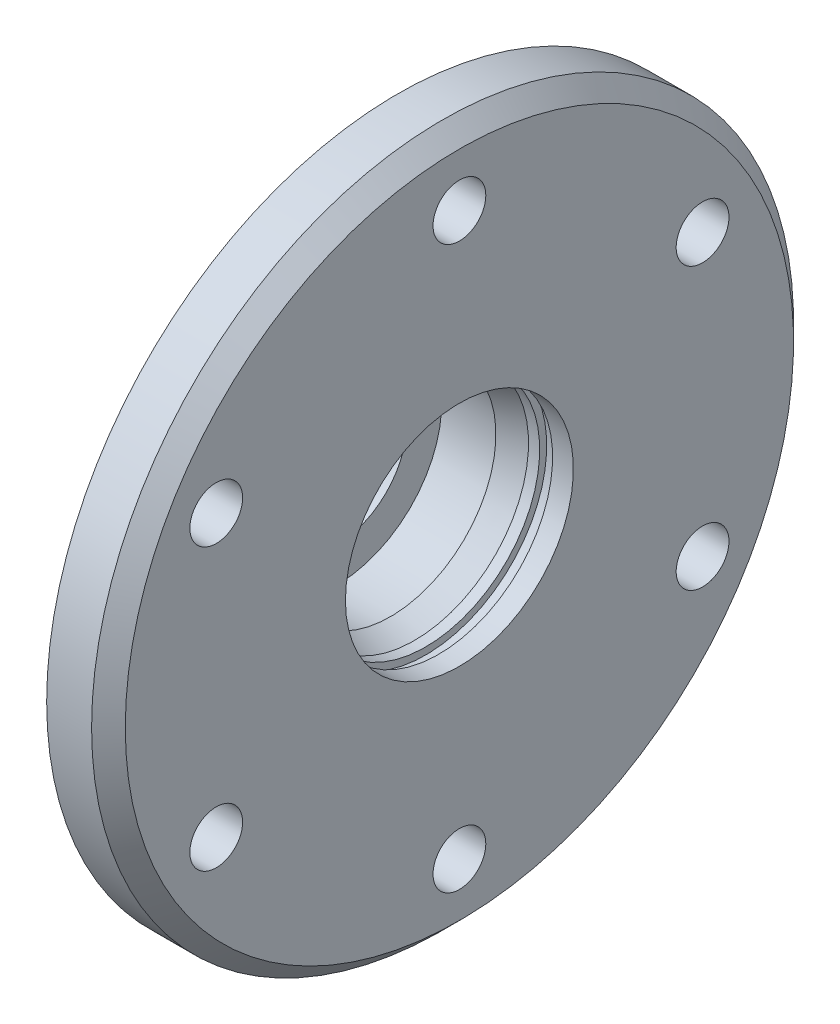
from build123d import *

# Parameters (mm, degrees)
FILLET1_R          = 0.127
CHAMFER1_SIZE      = 1.524
SKETCH2_R          = 2.3876
CUT_EXTRUDE1_DEPTH = 49.368589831


with BuildPart() as part:
    # Sketch1 → Base-Revolve (revolve)
    with BuildSketch(Plane.XY, mode=Mode.PRIVATE) as base_revolve_sk:
        Polygon((0, 14.2875), (12.3952, 14.2875), (12.3952, 15.875), (14.351, 15.875), (14.351, 19.4056), (12.3952, 19.4056), (12.3952, 31.75), (17.9832, 31.75), (17.9832, 10.3124), (16.1036, 10.3124), (16.1036, 10.9474), (14.9352, 10.9474), (14.9352, 10.3124), (13.92356372, 10.3124), (11.7602, 9.525), (6.858, 9.525), (6.858, 6.3754), (3.048, 6.3754), (3.048, 10.9982), (0, 10.9982), align=None)
    revolve(base_revolve_sk.sketch.rotate(Axis((0, 0, 0), (1, 0, 0)), 90), axis=Axis((0, 0, 0), (1, 0, 0)))

    # Fillet1
    fillet1_edges = [part.edges().sort_by_distance(p)[0] for p in [
        (12.3952, 0, -15.875),
        (12.3952, 0, -19.4056),
    ]]
    fillet(fillet1_edges, radius=FILLET1_R)

    # Chamfer1
    chamfer1_edges = [part.edges().sort_by_distance(p)[0] for p in [
        (0, 0, -14.2875),
        (17.9832, 0, -31.75),
    ]]
    chamfer(chamfer1_edges, length=CHAMFER1_SIZE)

    # Sketch2 → Cut-Extrude1 (cut, through all)
    with BuildSketch(Plane(origin=(17.9832, 0, 0), x_dir=(0, 0, -1), z_dir=(1, 0, 0))):
        with Locations((0, 25.4)):
            Circle(SKETCH2_R)
        with Locations((21.997045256, 12.7)):
            Circle(SKETCH2_R)
        with Locations((21.997045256, -12.7)):
            Circle(SKETCH2_R)
        with Locations((0, -25.4)):
            Circle(SKETCH2_R)
        with Locations((-21.997045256, -12.7)):
            Circle(SKETCH2_R)
        with Locations((-21.997045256, 12.7)):
            Circle(SKETCH2_R)
    extrude(amount=-CUT_EXTRUDE1_DEPTH, mode=Mode.SUBTRACT)


solid = part.part
